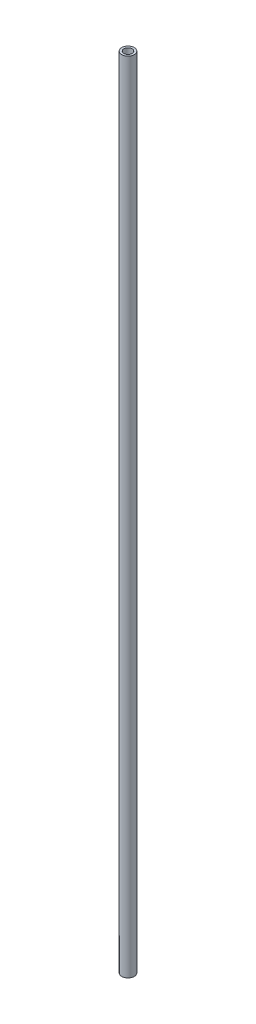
ISO-10303-21;
HEADER;
FILE_DESCRIPTION(('STEP AP214'),'2;1');
FILE_NAME('part.step','',(''),(''),'','','');
FILE_SCHEMA(('AUTOMOTIVE_DESIGN { 1 0 10303 214 1 1 1 1 }'));
ENDSEC;
DATA;
#1=APPLICATION_CONTEXT('core data for automotive mechanical design processes');
#2=APPLICATION_PROTOCOL_DEFINITION('international standard','automotive_design',2000,#1);
#3=PRODUCT_CONTEXT('',#1,'mechanical');
#4=PRODUCT('Part','Part','',(#3));
#5=PRODUCT_RELATED_PRODUCT_CATEGORY('part','',(#4));
#6=PRODUCT_DEFINITION_FORMATION('','',#4);
#7=PRODUCT_DEFINITION_CONTEXT('part definition',#1,'design');
#8=PRODUCT_DEFINITION('design','',#6,#7);
#9=PRODUCT_DEFINITION_SHAPE('','',#8);
#10=(LENGTH_UNIT() NAMED_UNIT(*) SI_UNIT(.MILLI.,.METRE.));
#11=(NAMED_UNIT(*) PLANE_ANGLE_UNIT() SI_UNIT($,.RADIAN.));
#12=(NAMED_UNIT(*) SI_UNIT($,.STERADIAN.) SOLID_ANGLE_UNIT());
#13=UNCERTAINTY_MEASURE_WITH_UNIT(LENGTH_MEASURE(1.E-05),#10,'distance_accuracy_value','');
#14=(GEOMETRIC_REPRESENTATION_CONTEXT(3) GLOBAL_UNCERTAINTY_ASSIGNED_CONTEXT((#13)) GLOBAL_UNIT_ASSIGNED_CONTEXT((#10,
#11,#12)) REPRESENTATION_CONTEXT('',''));
#15=CARTESIAN_POINT('',(0.,0.,0.));
#16=DIRECTION('',(0.,0.,1.));
#17=DIRECTION('',(1.,0.,0.));
#18=AXIS2_PLACEMENT_3D('',#15,#16,#17);
#19=CARTESIAN_POINT('',(0.,304.8,0.));
#20=DIRECTION('',(0.,1.,0.));
#21=DIRECTION('',(0.,0.,1.));
#22=AXIS2_PLACEMENT_3D('',#19,#20,#21);
#23=PLANE('',#22);
#24=CARTESIAN_POINT('',(0.,304.8,0.));
#25=DIRECTION('',(0.,1.,0.));
#26=DIRECTION('',(0.,0.,1.));
#27=AXIS2_PLACEMENT_3D('',#24,#25,#26);
#28=CIRCLE('',#27,2.38125);
#29=CARTESIAN_POINT('',(0.,304.8,-2.38125));
#30=VERTEX_POINT('',#29);
#31=EDGE_CURVE('E10',#30,#30,#28,.T.);
#32=ORIENTED_EDGE('',*,*,#31,.T.);
#33=EDGE_LOOP('',(#32));
#34=FACE_BOUND('',#33,.T.);
#35=CARTESIAN_POINT('',(0.,304.8,0.));
#36=DIRECTION('',(0.,1.,0.));
#37=DIRECTION('',(0.,0.,1.));
#38=AXIS2_PLACEMENT_3D('',#35,#36,#37);
#39=CIRCLE('',#38,1.5621);
#40=CARTESIAN_POINT('',(0.,304.8,-1.5621));
#41=VERTEX_POINT('',#40);
#42=EDGE_CURVE('E41',#41,#41,#39,.T.);
#43=ORIENTED_EDGE('',*,*,#42,.F.);
#44=EDGE_LOOP('',(#43));
#45=FACE_BOUND('',#44,.T.);
#46=ADVANCED_FACE('F30',(#34,#45),#23,.T.);
#47=CARTESIAN_POINT('',(0.,0.,0.));
#48=DIRECTION('',(0.,1.,0.));
#49=DIRECTION('',(0.,0.,1.));
#50=AXIS2_PLACEMENT_3D('',#47,#48,#49);
#51=PLANE('',#50);
#52=CARTESIAN_POINT('',(0.,0.,0.));
#53=DIRECTION('',(0.,1.,0.));
#54=DIRECTION('',(0.,0.,1.));
#55=AXIS2_PLACEMENT_3D('',#52,#53,#54);
#56=CIRCLE('',#55,2.38125);
#57=CARTESIAN_POINT('',(0.,0.,-2.38125));
#58=VERTEX_POINT('',#57);
#59=EDGE_CURVE('E34',#58,#58,#56,.T.);
#60=ORIENTED_EDGE('',*,*,#59,.F.);
#61=EDGE_LOOP('',(#60));
#62=FACE_BOUND('',#61,.T.);
#63=CARTESIAN_POINT('',(0.,0.,0.));
#64=DIRECTION('',(0.,1.,0.));
#65=DIRECTION('',(0.,0.,1.));
#66=AXIS2_PLACEMENT_3D('',#63,#64,#65);
#67=CIRCLE('',#66,1.5621);
#68=CARTESIAN_POINT('',(0.,0.,-1.5621));
#69=VERTEX_POINT('',#68);
#70=EDGE_CURVE('E43',#69,#69,#67,.T.);
#71=ORIENTED_EDGE('',*,*,#70,.T.);
#72=EDGE_LOOP('',(#71));
#73=FACE_BOUND('',#72,.T.);
#74=ADVANCED_FACE('F53',(#62,#73),#51,.F.);
#75=CARTESIAN_POINT('',(0.,304.8,0.));
#76=DIRECTION('',(0.,-1.,0.));
#77=DIRECTION('',(0.,0.,-1.));
#78=AXIS2_PLACEMENT_3D('',#75,#76,#77);
#79=CYLINDRICAL_SURFACE('',#78,2.38125);
#80=CARTESIAN_POINT('',(0.,304.8,-2.38125));
#81=CARTESIAN_POINT('',(0.,301.625,-2.38125));
#82=CARTESIAN_POINT('',(0.,298.45,-2.38125));
#83=CARTESIAN_POINT('',(0.,292.1,-2.38125));
#84=CARTESIAN_POINT('',(0.,288.925,-2.38125));
#85=CARTESIAN_POINT('',(0.,282.575,-2.38125));
#86=CARTESIAN_POINT('',(0.,279.4,-2.38125));
#87=CARTESIAN_POINT('',(0.,273.05,-2.38125));
#88=CARTESIAN_POINT('',(0.,269.875,-2.38125));
#89=CARTESIAN_POINT('',(0.,263.525,-2.38125));
#90=CARTESIAN_POINT('',(0.,260.35,-2.38125));
#91=CARTESIAN_POINT('',(0.,254.,-2.38125));
#92=CARTESIAN_POINT('',(0.,250.825,-2.38125));
#93=CARTESIAN_POINT('',(0.,244.475,-2.38125));
#94=CARTESIAN_POINT('',(0.,241.3,-2.38125));
#95=CARTESIAN_POINT('',(0.,234.95,-2.38125));
#96=CARTESIAN_POINT('',(0.,231.775,-2.38125));
#97=CARTESIAN_POINT('',(0.,225.425,-2.38125));
#98=CARTESIAN_POINT('',(0.,222.25,-2.38125));
#99=CARTESIAN_POINT('',(0.,215.9,-2.38125));
#100=CARTESIAN_POINT('',(0.,212.725,-2.38125));
#101=CARTESIAN_POINT('',(0.,206.375,-2.38125));
#102=CARTESIAN_POINT('',(0.,203.2,-2.38125));
#103=CARTESIAN_POINT('',(0.,196.85,-2.38125));
#104=CARTESIAN_POINT('',(0.,193.675,-2.38125));
#105=CARTESIAN_POINT('',(0.,187.325,-2.38125));
#106=CARTESIAN_POINT('',(0.,184.15,-2.38125));
#107=CARTESIAN_POINT('',(0.,177.8,-2.38125));
#108=CARTESIAN_POINT('',(0.,174.625,-2.38125));
#109=CARTESIAN_POINT('',(0.,168.275,-2.38125));
#110=CARTESIAN_POINT('',(0.,165.1,-2.38125));
#111=CARTESIAN_POINT('',(0.,158.75,-2.38125));
#112=CARTESIAN_POINT('',(0.,155.575,-2.38125));
#113=CARTESIAN_POINT('',(0.,149.225,-2.38125));
#114=CARTESIAN_POINT('',(0.,146.05,-2.38125));
#115=CARTESIAN_POINT('',(0.,139.7,-2.38125));
#116=CARTESIAN_POINT('',(0.,136.525,-2.38125));
#117=CARTESIAN_POINT('',(0.,130.175,-2.38125));
#118=CARTESIAN_POINT('',(0.,127.,-2.38125));
#119=CARTESIAN_POINT('',(0.,120.65,-2.38125));
#120=CARTESIAN_POINT('',(0.,117.475,-2.38125));
#121=CARTESIAN_POINT('',(0.,111.125,-2.38125));
#122=CARTESIAN_POINT('',(0.,107.95,-2.38125));
#123=CARTESIAN_POINT('',(0.,101.6,-2.38125));
#124=CARTESIAN_POINT('',(0.,98.425,-2.38125));
#125=CARTESIAN_POINT('',(0.,92.075,-2.38125));
#126=CARTESIAN_POINT('',(0.,88.9,-2.38125));
#127=CARTESIAN_POINT('',(0.,82.55,-2.38125));
#128=CARTESIAN_POINT('',(0.,79.375,-2.38125));
#129=CARTESIAN_POINT('',(0.,73.025,-2.38125));
#130=CARTESIAN_POINT('',(0.,69.85,-2.38125));
#131=CARTESIAN_POINT('',(0.,63.5,-2.38125));
#132=CARTESIAN_POINT('',(0.,60.325,-2.38125));
#133=CARTESIAN_POINT('',(0.,53.975,-2.38125));
#134=CARTESIAN_POINT('',(0.,50.8,-2.38125));
#135=CARTESIAN_POINT('',(0.,44.45,-2.38125));
#136=CARTESIAN_POINT('',(0.,41.275,-2.38125));
#137=CARTESIAN_POINT('',(0.,34.925,-2.38125));
#138=CARTESIAN_POINT('',(0.,31.75,-2.38125));
#139=CARTESIAN_POINT('',(0.,25.4,-2.38125));
#140=CARTESIAN_POINT('',(0.,22.225,-2.38125));
#141=CARTESIAN_POINT('',(0.,15.875,-2.38125));
#142=CARTESIAN_POINT('',(0.,12.7,-2.38125));
#143=CARTESIAN_POINT('',(0.,6.35,-2.38125));
#144=CARTESIAN_POINT('',(0.,3.175,-2.38125));
#145=CARTESIAN_POINT('',(0.,0.,-2.38125));
#146=B_SPLINE_CURVE_WITH_KNOTS('',3,(#80,#81,#82,#83,#84,#85,#86,#87,#88,#89,#90,#91,#92,#93,
#94,#95,#96,#97,#98,#99,#100,#101,#102,#103,#104,#105,#106,#107,#108,#109,#110,#111,#112,#113,
#114,#115,#116,#117,#118,#119,#120,#121,#122,#123,#124,#125,#126,#127,#128,#129,#130,#131,#132,
#133,#134,#135,#136,#137,#138,#139,#140,#141,#142,#143,#144,#145),.UNSPECIFIED.,.F.,.F.,(4,2,2,
2,2,2,2,2,2,2,2,2,2,2,2,2,2,2,2,2,2,2,2,2,2,2,2,2,2,2,2,2,4),(0.,9.52499999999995,19.05,28.575,
38.1,47.625,57.15,66.675,76.2,85.725,95.2499999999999,104.775,114.3,123.825,133.35,142.875,
152.4,161.925,171.45,180.975,190.5,200.025,209.55,219.075,228.6,238.125,247.65,257.175,266.7,
276.225,285.75,295.275,304.8),.UNSPECIFIED.);
#147=EDGE_CURVE('BSEAM32',#30,#58,#146,.T.);
#148=ORIENTED_EDGE('',*,*,#31,.F.);
#149=ORIENTED_EDGE('',*,*,#59,.T.);
#150=ORIENTED_EDGE('',*,*,#147,.T.);
#151=ORIENTED_EDGE('',*,*,#147,.F.);
#152=EDGE_LOOP('',(#148,#150,#149,#151));
#153=FACE_BOUND('',#152,.T.);
#154=ADVANCED_FACE('F32',(#153),#79,.T.);
#155=CARTESIAN_POINT('',(0.,304.8,0.));
#156=DIRECTION('',(0.,-1.,0.));
#157=DIRECTION('',(0.,0.,-1.));
#158=AXIS2_PLACEMENT_3D('',#155,#156,#157);
#159=CYLINDRICAL_SURFACE('',#158,1.5621);
#160=CARTESIAN_POINT('',(0.,304.8,-1.5621));
#161=CARTESIAN_POINT('',(0.,301.625,-1.5621));
#162=CARTESIAN_POINT('',(0.,298.45,-1.5621));
#163=CARTESIAN_POINT('',(0.,292.1,-1.5621));
#164=CARTESIAN_POINT('',(0.,288.925,-1.5621));
#165=CARTESIAN_POINT('',(0.,282.575,-1.5621));
#166=CARTESIAN_POINT('',(0.,279.4,-1.5621));
#167=CARTESIAN_POINT('',(0.,273.05,-1.5621));
#168=CARTESIAN_POINT('',(0.,269.875,-1.5621));
#169=CARTESIAN_POINT('',(0.,263.525,-1.5621));
#170=CARTESIAN_POINT('',(0.,260.35,-1.5621));
#171=CARTESIAN_POINT('',(0.,254.,-1.5621));
#172=CARTESIAN_POINT('',(0.,250.825,-1.5621));
#173=CARTESIAN_POINT('',(0.,244.475,-1.5621));
#174=CARTESIAN_POINT('',(0.,241.3,-1.5621));
#175=CARTESIAN_POINT('',(0.,234.95,-1.5621));
#176=CARTESIAN_POINT('',(0.,231.775,-1.5621));
#177=CARTESIAN_POINT('',(0.,225.425,-1.5621));
#178=CARTESIAN_POINT('',(0.,222.25,-1.5621));
#179=CARTESIAN_POINT('',(0.,215.9,-1.5621));
#180=CARTESIAN_POINT('',(0.,212.725,-1.5621));
#181=CARTESIAN_POINT('',(0.,206.375,-1.5621));
#182=CARTESIAN_POINT('',(0.,203.2,-1.5621));
#183=CARTESIAN_POINT('',(0.,196.85,-1.5621));
#184=CARTESIAN_POINT('',(0.,193.675,-1.5621));
#185=CARTESIAN_POINT('',(0.,187.325,-1.5621));
#186=CARTESIAN_POINT('',(0.,184.15,-1.5621));
#187=CARTESIAN_POINT('',(0.,177.8,-1.5621));
#188=CARTESIAN_POINT('',(0.,174.625,-1.5621));
#189=CARTESIAN_POINT('',(0.,168.275,-1.5621));
#190=CARTESIAN_POINT('',(0.,165.1,-1.5621));
#191=CARTESIAN_POINT('',(0.,158.75,-1.5621));
#192=CARTESIAN_POINT('',(0.,155.575,-1.5621));
#193=CARTESIAN_POINT('',(0.,149.225,-1.5621));
#194=CARTESIAN_POINT('',(0.,146.05,-1.5621));
#195=CARTESIAN_POINT('',(0.,139.7,-1.5621));
#196=CARTESIAN_POINT('',(0.,136.525,-1.5621));
#197=CARTESIAN_POINT('',(0.,130.175,-1.5621));
#198=CARTESIAN_POINT('',(0.,127.,-1.5621));
#199=CARTESIAN_POINT('',(0.,120.65,-1.5621));
#200=CARTESIAN_POINT('',(0.,117.475,-1.5621));
#201=CARTESIAN_POINT('',(0.,111.125,-1.5621));
#202=CARTESIAN_POINT('',(0.,107.95,-1.5621));
#203=CARTESIAN_POINT('',(0.,101.6,-1.5621));
#204=CARTESIAN_POINT('',(0.,98.425,-1.5621));
#205=CARTESIAN_POINT('',(0.,92.075,-1.5621));
#206=CARTESIAN_POINT('',(0.,88.9,-1.5621));
#207=CARTESIAN_POINT('',(0.,82.55,-1.5621));
#208=CARTESIAN_POINT('',(0.,79.375,-1.5621));
#209=CARTESIAN_POINT('',(0.,73.025,-1.5621));
#210=CARTESIAN_POINT('',(0.,69.85,-1.5621));
#211=CARTESIAN_POINT('',(0.,63.5,-1.5621));
#212=CARTESIAN_POINT('',(0.,60.325,-1.5621));
#213=CARTESIAN_POINT('',(0.,53.975,-1.5621));
#214=CARTESIAN_POINT('',(0.,50.8,-1.5621));
#215=CARTESIAN_POINT('',(0.,44.45,-1.5621));
#216=CARTESIAN_POINT('',(0.,41.275,-1.5621));
#217=CARTESIAN_POINT('',(0.,34.925,-1.5621));
#218=CARTESIAN_POINT('',(0.,31.75,-1.5621));
#219=CARTESIAN_POINT('',(0.,25.4,-1.5621));
#220=CARTESIAN_POINT('',(0.,22.225,-1.5621));
#221=CARTESIAN_POINT('',(0.,15.875,-1.5621));
#222=CARTESIAN_POINT('',(0.,12.7,-1.5621));
#223=CARTESIAN_POINT('',(0.,6.35,-1.5621));
#224=CARTESIAN_POINT('',(0.,3.175,-1.5621));
#225=CARTESIAN_POINT('',(0.,0.,-1.5621));
#226=B_SPLINE_CURVE_WITH_KNOTS('',3,(#160,#161,#162,#163,#164,#165,#166,#167,#168,#169,#170,
#171,#172,#173,#174,#175,#176,#177,#178,#179,#180,#181,#182,#183,#184,#185,#186,#187,#188,#189,
#190,#191,#192,#193,#194,#195,#196,#197,#198,#199,#200,#201,#202,#203,#204,#205,#206,#207,#208,
#209,#210,#211,#212,#213,#214,#215,#216,#217,#218,#219,#220,#221,#222,#223,#224,#225),
.UNSPECIFIED.,.F.,.F.,(4,2,2,2,2,2,2,2,2,2,2,2,2,2,2,2,2,2,2,2,2,2,2,2,2,2,2,2,2,2,2,2,4),(0.,
9.52499999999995,19.05,28.575,38.1,47.625,57.15,66.675,76.2,85.725,95.2499999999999,104.775,
114.3,123.825,133.35,142.875,152.4,161.925,171.45,180.975,190.5,200.025,209.55,219.075,228.6,
238.125,247.65,257.175,266.7,276.225,285.75,295.275,304.8),.UNSPECIFIED.);
#227=EDGE_CURVE('BSEAM49',#41,#69,#226,.T.);
#228=ORIENTED_EDGE('',*,*,#42,.T.);
#229=ORIENTED_EDGE('',*,*,#70,.F.);
#230=ORIENTED_EDGE('',*,*,#227,.T.);
#231=ORIENTED_EDGE('',*,*,#227,.F.);
#232=EDGE_LOOP('',(#228,#230,#229,#231));
#233=FACE_BOUND('',#232,.T.);
#234=ADVANCED_FACE('F49',(#233),#159,.F.);
#235=CLOSED_SHELL('',(#46,#74,#154,#234));
#236=MANIFOLD_SOLID_BREP('B2',#235);
#237=ADVANCED_BREP_SHAPE_REPRESENTATION('',(#18,#236),#14);
#238=SHAPE_DEFINITION_REPRESENTATION(#9,#237);
ENDSEC;
END-ISO-10303-21;
